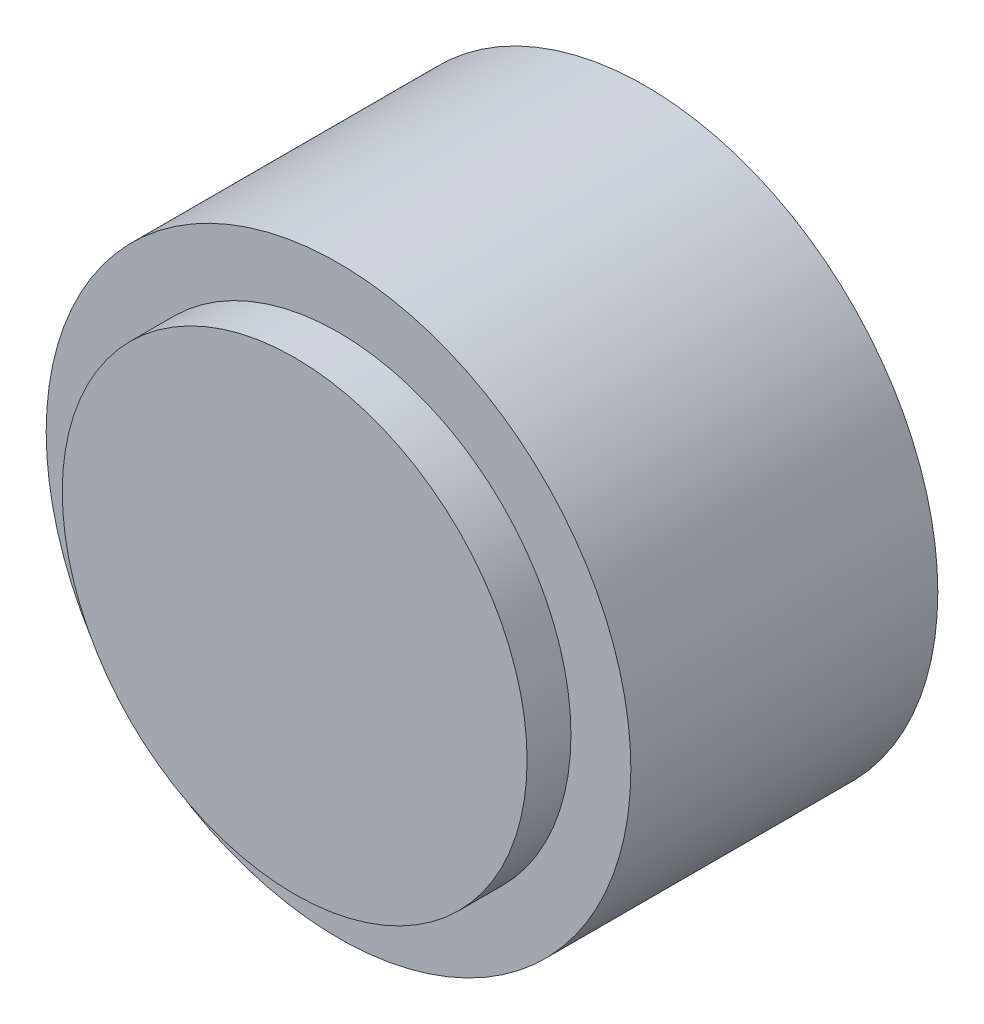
ISO-10303-21;
HEADER;
FILE_DESCRIPTION(('STEP AP214'),'2;1');
FILE_NAME('part.step','',(''),(''),'','','');
FILE_SCHEMA(('AUTOMOTIVE_DESIGN { 1 0 10303 214 1 1 1 1 }'));
ENDSEC;
DATA;
#1=APPLICATION_CONTEXT('core data for automotive mechanical design processes');
#2=APPLICATION_PROTOCOL_DEFINITION('international standard','automotive_design',2000,#1);
#3=PRODUCT_CONTEXT('',#1,'mechanical');
#4=PRODUCT('Part','Part','',(#3));
#5=PRODUCT_RELATED_PRODUCT_CATEGORY('part','',(#4));
#6=PRODUCT_DEFINITION_FORMATION('','',#4);
#7=PRODUCT_DEFINITION_CONTEXT('part definition',#1,'design');
#8=PRODUCT_DEFINITION('design','',#6,#7);
#9=PRODUCT_DEFINITION_SHAPE('','',#8);
#10=(LENGTH_UNIT() NAMED_UNIT(*) SI_UNIT(.MILLI.,.METRE.));
#11=(NAMED_UNIT(*) PLANE_ANGLE_UNIT() SI_UNIT($,.RADIAN.));
#12=(NAMED_UNIT(*) SI_UNIT($,.STERADIAN.) SOLID_ANGLE_UNIT());
#13=UNCERTAINTY_MEASURE_WITH_UNIT(LENGTH_MEASURE(1.E-05),#10,'distance_accuracy_value','');
#14=(GEOMETRIC_REPRESENTATION_CONTEXT(3) GLOBAL_UNCERTAINTY_ASSIGNED_CONTEXT((#13)) GLOBAL_UNIT_ASSIGNED_CONTEXT((#10,
#11,#12)) REPRESENTATION_CONTEXT('',''));
#15=CARTESIAN_POINT('',(0.,0.,0.));
#16=DIRECTION('',(0.,0.,1.));
#17=DIRECTION('',(1.,0.,0.));
#18=AXIS2_PLACEMENT_3D('',#15,#16,#17);
#19=CARTESIAN_POINT('',(0.,0.,32.));
#20=DIRECTION('',(0.,0.,1.));
#21=DIRECTION('',(1.,0.,0.));
#22=AXIS2_PLACEMENT_3D('',#19,#20,#21);
#23=CYLINDRICAL_SURFACE('',#22,10.);
#24=CARTESIAN_POINT('',(0.,0.,0.));
#25=DIRECTION('',(0.,0.,1.));
#26=DIRECTION('',(1.,0.,0.));
#27=AXIS2_PLACEMENT_3D('',#24,#25,#26);
#28=CIRCLE('',#27,10.);
#29=CARTESIAN_POINT('',(10.,0.,0.));
#30=VERTEX_POINT('',#29);
#31=EDGE_CURVE('E8',#30,#30,#28,.T.);
#32=ORIENTED_EDGE('',*,*,#31,.T.);
#33=EDGE_LOOP('',(#32));
#34=FACE_BOUND('',#33,.T.);
#35=CARTESIAN_POINT('',(0.,0.,10.5));
#36=DIRECTION('',(0.,0.,1.));
#37=DIRECTION('',(1.,0.,0.));
#38=AXIS2_PLACEMENT_3D('',#35,#36,#37);
#39=CIRCLE('',#38,10.);
#40=CARTESIAN_POINT('',(10.,0.,10.5));
#41=VERTEX_POINT('',#40);
#42=EDGE_CURVE('E29',#41,#41,#39,.T.);
#43=ORIENTED_EDGE('',*,*,#42,.F.);
#44=EDGE_LOOP('',(#43));
#45=FACE_BOUND('',#44,.T.);
#46=ADVANCED_FACE('F13',(#34,#45),#23,.T.);
#47=CARTESIAN_POINT('',(3.,0.,0.));
#48=DIRECTION('',(0.,0.,1.));
#49=DIRECTION('',(1.,0.,0.));
#50=AXIS2_PLACEMENT_3D('',#47,#48,#49);
#51=PLANE('',#50);
#52=ORIENTED_EDGE('',*,*,#31,.F.);
#53=EDGE_LOOP('',(#52));
#54=FACE_BOUND('',#53,.T.);
#55=CARTESIAN_POINT('',(0.,0.,0.));
#56=DIRECTION('',(0.,0.,1.));
#57=DIRECTION('',(1.,0.,0.));
#58=AXIS2_PLACEMENT_3D('',#55,#56,#57);
#59=CIRCLE('',#58,3.);
#60=CARTESIAN_POINT('',(3.,0.,0.));
#61=VERTEX_POINT('',#60);
#62=EDGE_CURVE('E20',#61,#61,#59,.T.);
#63=ORIENTED_EDGE('',*,*,#62,.T.);
#64=EDGE_LOOP('',(#63));
#65=FACE_BOUND('',#64,.T.);
#66=ADVANCED_FACE('F42',(#54,#65),#51,.F.);
#67=CARTESIAN_POINT('',(0.,0.,32.));
#68=DIRECTION('',(0.,0.,1.));
#69=DIRECTION('',(1.,0.,0.));
#70=AXIS2_PLACEMENT_3D('',#67,#68,#69);
#71=CYLINDRICAL_SURFACE('',#70,3.);
#72=CARTESIAN_POINT('',(0.,0.,7.8));
#73=DIRECTION('',(0.,0.,-1.));
#74=DIRECTION('',(-1.,0.,0.));
#75=AXIS2_PLACEMENT_3D('',#72,#73,#74);
#76=CIRCLE('',#75,3.);
#77=CARTESIAN_POINT('',(-3.,0.,7.8));
#78=VERTEX_POINT('',#77);
#79=EDGE_CURVE('E32',#78,#78,#76,.T.);
#80=ORIENTED_EDGE('',*,*,#79,.F.);
#81=EDGE_LOOP('',(#80));
#82=FACE_BOUND('',#81,.T.);
#83=ORIENTED_EDGE('',*,*,#62,.F.);
#84=EDGE_LOOP('',(#83));
#85=FACE_BOUND('',#84,.T.);
#86=ADVANCED_FACE('F38',(#82,#85),#71,.F.);
#87=CARTESIAN_POINT('',(0.,0.,20.));
#88=DIRECTION('',(0.,0.,1.));
#89=DIRECTION('',(1.,0.,0.));
#90=AXIS2_PLACEMENT_3D('',#87,#88,#89);
#91=CYLINDRICAL_SURFACE('',#90,7.95);
#92=CARTESIAN_POINT('',(0.,0.,10.5));
#93=DIRECTION('',(0.,0.,1.));
#94=DIRECTION('',(1.,0.,0.));
#95=AXIS2_PLACEMENT_3D('',#92,#93,#94);
#96=CIRCLE('',#95,7.95);
#97=CARTESIAN_POINT('',(7.95,0.,10.5));
#98=VERTEX_POINT('',#97);
#99=EDGE_CURVE('E26',#98,#98,#96,.T.);
#100=ORIENTED_EDGE('',*,*,#99,.T.);
#101=EDGE_LOOP('',(#100));
#102=FACE_BOUND('',#101,.T.);
#103=CARTESIAN_POINT('',(0.,0.,12.));
#104=DIRECTION('',(0.,0.,-1.));
#105=DIRECTION('',(-1.,0.,0.));
#106=AXIS2_PLACEMENT_3D('',#103,#104,#105);
#107=CIRCLE('',#106,7.95);
#108=CARTESIAN_POINT('',(-7.95,0.,12.));
#109=VERTEX_POINT('',#108);
#110=EDGE_CURVE('E16',#109,#109,#107,.T.);
#111=ORIENTED_EDGE('',*,*,#110,.T.);
#112=EDGE_LOOP('',(#111));
#113=FACE_BOUND('',#112,.T.);
#114=ADVANCED_FACE('F41',(#102,#113),#91,.T.);
#115=CARTESIAN_POINT('',(-7.95,0.,10.5));
#116=DIRECTION('',(0.,0.,1.));
#117=DIRECTION('',(1.,0.,0.));
#118=AXIS2_PLACEMENT_3D('',#115,#116,#117);
#119=PLANE('',#118);
#120=ORIENTED_EDGE('',*,*,#42,.T.);
#121=EDGE_LOOP('',(#120));
#122=FACE_BOUND('',#121,.T.);
#123=ORIENTED_EDGE('',*,*,#99,.F.);
#124=EDGE_LOOP('',(#123));
#125=FACE_BOUND('',#124,.T.);
#126=ADVANCED_FACE('F56',(#122,#125),#119,.T.);
#127=CARTESIAN_POINT('',(10.,0.,12.));
#128=DIRECTION('',(0.,0.,-1.));
#129=DIRECTION('',(-1.,0.,0.));
#130=AXIS2_PLACEMENT_3D('',#127,#128,#129);
#131=PLANE('',#130);
#132=ORIENTED_EDGE('',*,*,#110,.F.);
#133=EDGE_LOOP('',(#132));
#134=FACE_BOUND('',#133,.T.);
#135=ADVANCED_FACE('F53',(#134),#131,.F.);
#136=CARTESIAN_POINT('',(0.,0.,7.8));
#137=DIRECTION('',(0.,0.,-1.));
#138=DIRECTION('',(-1.,0.,0.));
#139=AXIS2_PLACEMENT_3D('',#136,#137,#138);
#140=PLANE('',#139);
#141=ORIENTED_EDGE('',*,*,#79,.T.);
#142=EDGE_LOOP('',(#141));
#143=FACE_BOUND('',#142,.T.);
#144=ADVANCED_FACE('F36',(#143),#140,.T.);
#145=CLOSED_SHELL('',(#46,#66,#86,#114,#126,#135,#144));
#146=MANIFOLD_SOLID_BREP('B1',#145);
#147=ADVANCED_BREP_SHAPE_REPRESENTATION('',(#18,#146),#14);
#148=SHAPE_DEFINITION_REPRESENTATION(#9,#147);
ENDSEC;
END-ISO-10303-21;
